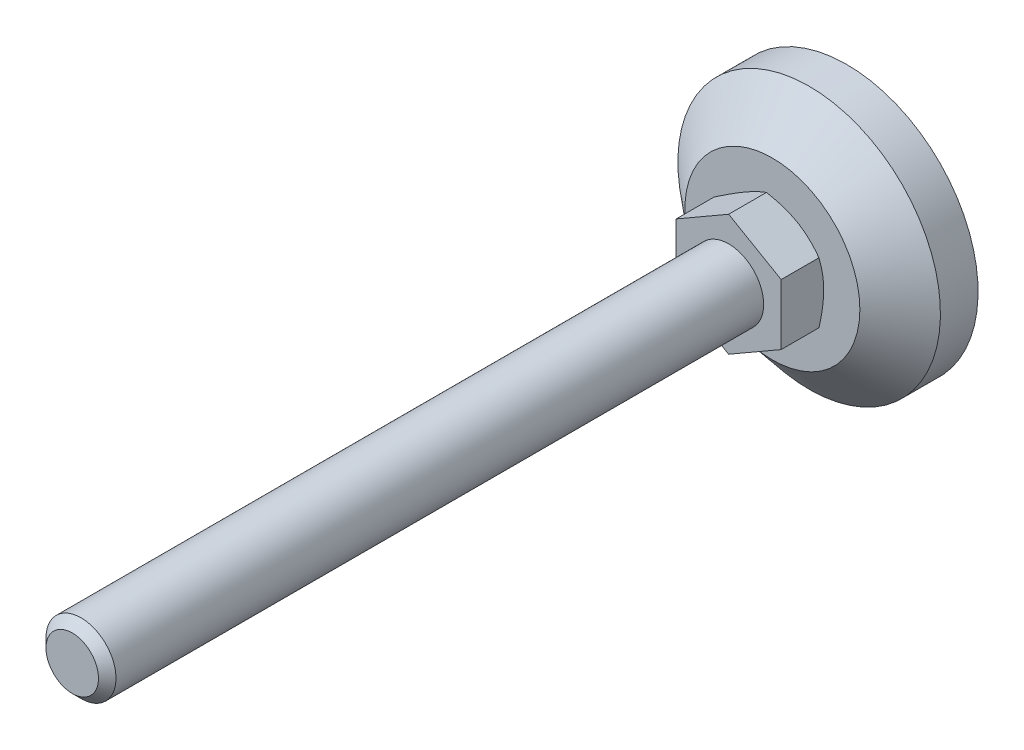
ISO-10303-21;
HEADER;
FILE_DESCRIPTION(('STEP AP214'),'2;1');
FILE_NAME('part.step','',(''),(''),'','','');
FILE_SCHEMA(('AUTOMOTIVE_DESIGN { 1 0 10303 214 1 1 1 1 }'));
ENDSEC;
DATA;
#1=APPLICATION_CONTEXT('core data for automotive mechanical design processes');
#2=APPLICATION_PROTOCOL_DEFINITION('international standard','automotive_design',2000,#1);
#3=PRODUCT_CONTEXT('',#1,'mechanical');
#4=PRODUCT('Part','Part','',(#3));
#5=PRODUCT_RELATED_PRODUCT_CATEGORY('part','',(#4));
#6=PRODUCT_DEFINITION_FORMATION('','',#4);
#7=PRODUCT_DEFINITION_CONTEXT('part definition',#1,'design');
#8=PRODUCT_DEFINITION('design','',#6,#7);
#9=PRODUCT_DEFINITION_SHAPE('','',#8);
#10=(LENGTH_UNIT() NAMED_UNIT(*) SI_UNIT(.MILLI.,.METRE.));
#11=(NAMED_UNIT(*) PLANE_ANGLE_UNIT() SI_UNIT($,.RADIAN.));
#12=(NAMED_UNIT(*) SI_UNIT($,.STERADIAN.) SOLID_ANGLE_UNIT());
#13=UNCERTAINTY_MEASURE_WITH_UNIT(LENGTH_MEASURE(1.E-05),#10,'distance_accuracy_value','');
#14=(GEOMETRIC_REPRESENTATION_CONTEXT(3) GLOBAL_UNCERTAINTY_ASSIGNED_CONTEXT((#13)) GLOBAL_UNIT_ASSIGNED_CONTEXT((#10,
#11,#12)) REPRESENTATION_CONTEXT('',''));
#15=CARTESIAN_POINT('',(0.,0.,0.));
#16=DIRECTION('',(0.,0.,1.));
#17=DIRECTION('',(1.,0.,0.));
#18=AXIS2_PLACEMENT_3D('',#15,#16,#17);
#19=CARTESIAN_POINT('',(0.,0.,27.));
#20=DIRECTION('',(0.,0.,1.));
#21=DIRECTION('',(0.5,-0.866025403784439,0.));
#22=AXIS2_PLACEMENT_3D('',#19,#20,#21);
#23=PLANE('',#22);
#24=DIRECTION('',(0.,1.,0.));
#25=VECTOR('',#24,1.);
#26=CARTESIAN_POINT('',(12.,-6.92820323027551,27.));
#27=LINE('',#26,#25);
#28=CARTESIAN_POINT('',(12.,-6.92820323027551,27.));
#29=VERTEX_POINT('',#28);
#30=CARTESIAN_POINT('',(12.,6.92820323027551,27.));
#31=VERTEX_POINT('',#30);
#32=EDGE_CURVE('E197',#29,#31,#27,.T.);
#33=ORIENTED_EDGE('',*,*,#32,.T.);
#34=DIRECTION('',(-0.866025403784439,0.5,0.));
#35=VECTOR('',#34,1.);
#36=CARTESIAN_POINT('',(12.,6.92820323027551,27.));
#37=LINE('',#36,#35);
#38=CARTESIAN_POINT('',(0.,13.856406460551,27.));
#39=VERTEX_POINT('',#38);
#40=EDGE_CURVE('E320',#31,#39,#37,.T.);
#41=ORIENTED_EDGE('',*,*,#40,.T.);
#42=DIRECTION('',(-0.866025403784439,-0.5,0.));
#43=VECTOR('',#42,1.);
#44=CARTESIAN_POINT('',(0.,13.856406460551,27.));
#45=LINE('',#44,#43);
#46=CARTESIAN_POINT('',(-12.,6.92820323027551,27.));
#47=VERTEX_POINT('',#46);
#48=EDGE_CURVE('E319',#39,#47,#45,.T.);
#49=ORIENTED_EDGE('',*,*,#48,.T.);
#50=DIRECTION('',(0.,-1.,0.));
#51=VECTOR('',#50,1.);
#52=CARTESIAN_POINT('',(-12.,6.92820323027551,27.));
#53=LINE('',#52,#51);
#54=CARTESIAN_POINT('',(-12.,-6.92820323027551,27.));
#55=VERTEX_POINT('',#54);
#56=EDGE_CURVE('E324',#47,#55,#53,.T.);
#57=ORIENTED_EDGE('',*,*,#56,.T.);
#58=DIRECTION('',(0.866025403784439,-0.5,0.));
#59=VECTOR('',#58,1.);
#60=CARTESIAN_POINT('',(-12.,-6.92820323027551,27.));
#61=LINE('',#60,#59);
#62=CARTESIAN_POINT('',(0.,-13.856406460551,27.));
#63=VERTEX_POINT('',#62);
#64=EDGE_CURVE('E326',#55,#63,#61,.T.);
#65=ORIENTED_EDGE('',*,*,#64,.T.);
#66=DIRECTION('',(0.866025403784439,0.5,0.));
#67=VECTOR('',#66,1.);
#68=CARTESIAN_POINT('',(0.,-13.856406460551,27.));
#69=LINE('',#68,#67);
#70=EDGE_CURVE('E37',#63,#29,#69,.T.);
#71=ORIENTED_EDGE('',*,*,#70,.T.);
#72=EDGE_LOOP('',(#33,#41,#49,#57,#65,#71));
#73=FACE_BOUND('',#72,.T.);
#74=CARTESIAN_POINT('',(0.,0.,27.));
#75=DIRECTION('',(0.,0.,1.));
#76=DIRECTION('',(0.5,-0.866025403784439,0.));
#77=AXIS2_PLACEMENT_3D('',#74,#75,#76);
#78=CIRCLE('',#77,8.);
#79=CARTESIAN_POINT('',(4.,-6.92820323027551,27.));
#80=VERTEX_POINT('',#79);
#81=EDGE_CURVE('E201',#80,#80,#78,.T.);
#82=ORIENTED_EDGE('',*,*,#81,.F.);
#83=EDGE_LOOP('',(#82));
#84=FACE_BOUND('',#83,.T.);
#85=ADVANCED_FACE('F14',(#73,#84),#23,.T.);
#86=CARTESIAN_POINT('',(-9.99463491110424,17.3112154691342,17.));
#87=DIRECTION('',(0.,0.,1.));
#88=DIRECTION('',(0.5,-0.866025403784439,0.));
#89=AXIS2_PLACEMENT_3D('',#86,#87,#88);
#90=PLANE('',#89);
#91=CARTESIAN_POINT('',(0.,0.,17.));
#92=DIRECTION('',(0.,0.,-1.));
#93=DIRECTION('',(-0.5,0.866025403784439,0.));
#94=AXIS2_PLACEMENT_3D('',#91,#92,#93);
#95=CIRCLE('',#94,19.9892698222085);
#96=CARTESIAN_POINT('',(-9.99463491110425,17.3112154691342,17.));
#97=VERTEX_POINT('',#96);
#98=EDGE_CURVE('E102',#97,#97,#95,.T.);
#99=ORIENTED_EDGE('',*,*,#98,.F.);
#100=EDGE_LOOP('',(#99));
#101=FACE_BOUND('',#100,.T.);
#102=CARTESIAN_POINT('',(0.,0.,17.));
#103=DIRECTION('',(0.,0.,-1.));
#104=DIRECTION('',(-0.5,0.866025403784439,0.));
#105=AXIS2_PLACEMENT_3D('',#102,#103,#104);
#106=CIRCLE('',#105,11.5);
#107=CARTESIAN_POINT('',(-5.75,9.95929214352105,17.));
#108=VERTEX_POINT('',#107);
#109=EDGE_CURVE('E84',#108,#108,#106,.T.);
#110=ORIENTED_EDGE('',*,*,#109,.T.);
#111=EDGE_LOOP('',(#110));
#112=FACE_BOUND('',#111,.T.);
#113=ADVANCED_FACE('F174',(#101,#112),#90,.T.);
#114=CARTESIAN_POINT('',(0.,0.,0.));
#115=DIRECTION('',(0.,0.,-1.));
#116=DIRECTION('',(-0.5,0.866025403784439,0.));
#117=AXIS2_PLACEMENT_3D('',#114,#115,#116);
#118=PLANE('',#117);
#119=CARTESIAN_POINT('',(0.,0.,0.));
#120=DIRECTION('',(0.,0.,-1.));
#121=DIRECTION('',(-0.5,0.866025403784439,0.));
#122=AXIS2_PLACEMENT_3D('',#119,#120,#121);
#123=CIRCLE('',#122,30.);
#124=CARTESIAN_POINT('',(-15.,25.9807621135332,0.));
#125=VERTEX_POINT('',#124);
#126=EDGE_CURVE('E73',#125,#125,#123,.T.);
#127=ORIENTED_EDGE('',*,*,#126,.T.);
#128=EDGE_LOOP('',(#127));
#129=FACE_BOUND('',#128,.T.);
#130=ADVANCED_FACE('F177',(#129),#118,.T.);
#131=CARTESIAN_POINT('',(0.,0.,-75.4972525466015));
#132=DIRECTION('',(0.,0.,-1.));
#133=DIRECTION('',(-0.5,0.866025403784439,0.));
#134=AXIS2_PLACEMENT_3D('',#131,#132,#133);
#135=CYLINDRICAL_SURFACE('',#134,30.);
#136=CARTESIAN_POINT('',(0.,0.,8.6));
#137=DIRECTION('',(0.,0.,-1.));
#138=DIRECTION('',(-0.5,0.866025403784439,0.));
#139=AXIS2_PLACEMENT_3D('',#136,#137,#138);
#140=CIRCLE('',#139,30.);
#141=CARTESIAN_POINT('',(-15.,25.9807621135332,8.6));
#142=VERTEX_POINT('',#141);
#143=EDGE_CURVE('E105',#142,#142,#140,.T.);
#144=ORIENTED_EDGE('',*,*,#143,.T.);
#145=EDGE_LOOP('',(#144));
#146=FACE_BOUND('',#145,.T.);
#147=ORIENTED_EDGE('',*,*,#126,.F.);
#148=EDGE_LOOP('',(#147));
#149=FACE_BOUND('',#148,.T.);
#150=ADVANCED_FACE('F181',(#146,#149),#135,.T.);
#151=CARTESIAN_POINT('',(0.,0.,8.6));
#152=DIRECTION('',(0.,0.,-1.));
#153=DIRECTION('',(-0.5,0.866025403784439,0.));
#154=AXIS2_PLACEMENT_3D('',#151,#152,#153);
#155=CONICAL_SURFACE('',#154,30.,0.872664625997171);
#156=ORIENTED_EDGE('',*,*,#98,.T.);
#157=EDGE_LOOP('',(#156));
#158=FACE_BOUND('',#157,.T.);
#159=ORIENTED_EDGE('',*,*,#143,.F.);
#160=EDGE_LOOP('',(#159));
#161=FACE_BOUND('',#160,.T.);
#162=ADVANCED_FACE('F121',(#158,#161),#155,.T.);
#163=CARTESIAN_POINT('',(0.,0.,20.8975219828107));
#164=DIRECTION('',(0.,0.,1.));
#165=DIRECTION('',(0.5,-0.866025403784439,0.));
#166=AXIS2_PLACEMENT_3D('',#163,#164,#165);
#167=CONICAL_SURFACE('',#166,18.2507060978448,1.0471975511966);
#168=ORIENTED_EDGE('',*,*,#109,.F.);
#169=EDGE_LOOP('',(#168));
#170=FACE_BOUND('',#169,.T.);
#171=CARTESIAN_POINT('',(-10.1845483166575,-19.7364581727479,23.1830146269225));
#172=CARTESIAN_POINT('',(-9.95731802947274,-19.6052667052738,23.0555465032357));
#173=CARTESIAN_POINT('',(-9.72982292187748,-19.4739223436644,22.9287081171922));
#174=CARTESIAN_POINT('',(-9.27424782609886,-19.2108959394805,22.6764332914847));
#175=CARTESIAN_POINT('',(-9.04616783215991,-19.0792138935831,22.5509968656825));
#176=CARTESIAN_POINT('',(-8.360907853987,-18.6835788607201,22.1769716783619));
#177=CARTESIAN_POINT('',(-7.90277404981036,-18.4190751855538,21.930704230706));
#178=CARTESIAN_POINT('',(-6.98100239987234,-17.8868900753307,21.4445247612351));
#179=CARTESIAN_POINT('',(-6.51734820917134,-17.6191992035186,21.2046539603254));
#180=CARTESIAN_POINT('',(-5.58637620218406,-17.0817022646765,20.734620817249));
#181=CARTESIAN_POINT('',(-5.11905855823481,-16.8118962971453,20.5044580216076));
#182=CARTESIAN_POINT('',(-4.16467967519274,-16.2608853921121,20.0490896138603));
#183=CARTESIAN_POINT('',(-3.67747196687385,-15.9795958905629,19.82429119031));
#184=CARTESIAN_POINT('',(-2.69737824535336,-15.413738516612,19.3915182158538));
#185=CARTESIAN_POINT('',(-2.20449160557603,-15.1291702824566,19.1835455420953));
#186=CARTESIAN_POINT('',(-1.21317256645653,-14.5568319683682,18.7898295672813));
#187=CARTESIAN_POINT('',(-0.714753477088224,-14.2690695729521,18.6040419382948));
#188=CARTESIAN_POINT('',(0.289281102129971,-13.6893899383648,18.2605950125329));
#189=CARTESIAN_POINT('',(0.794894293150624,-13.3974740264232,18.1029269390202));
#190=CARTESIAN_POINT('',(1.55740346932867,-12.9572391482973,17.8936125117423));
#191=CARTESIAN_POINT('',(1.81154649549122,-12.8105096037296,17.82851512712));
#192=CARTESIAN_POINT('',(2.3215816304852,-12.5160406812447,17.7081511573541));
#193=CARTESIAN_POINT('',(2.57747370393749,-12.3683013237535,17.652884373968));
#194=CARTESIAN_POINT('',(3.09083535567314,-12.0719118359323,17.5531523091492));
#195=CARTESIAN_POINT('',(3.34830490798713,-11.9232617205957,17.5086868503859));
#196=CARTESIAN_POINT('',(3.86455433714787,-11.6252049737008,17.4314414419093));
#197=CARTESIAN_POINT('',(4.12333416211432,-11.4757983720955,17.3986610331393));
#198=CARTESIAN_POINT('',(4.63843364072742,-11.1784055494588,17.345852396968));
#199=CARTESIAN_POINT('',(4.89474072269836,-11.0304265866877,17.3256616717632));
#200=CARTESIAN_POINT('',(5.40786438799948,-10.7341745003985,17.2978182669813));
#201=CARTESIAN_POINT('',(5.66468096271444,-10.5859013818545,17.2901653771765));
#202=CARTESIAN_POINT('',(6.17836497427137,-10.2893257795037,17.287579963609));
#203=CARTESIAN_POINT('',(6.43523241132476,-10.1410232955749,17.2926474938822));
#204=CARTESIAN_POINT('',(6.94855188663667,-9.84465815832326,17.3153783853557));
#205=CARTESIAN_POINT('',(7.20500390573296,-9.69659551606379,17.3330423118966));
#206=CARTESIAN_POINT('',(7.81927447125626,-9.34194623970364,17.3900614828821));
#207=CARTESIAN_POINT('',(8.17669346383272,-9.13559028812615,17.4352607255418));
#208=CARTESIAN_POINT('',(8.88892563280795,-8.72438285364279,17.5476838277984));
#209=CARTESIAN_POINT('',(9.24373845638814,-8.51953157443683,17.6149106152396));
#210=CARTESIAN_POINT('',(9.95040329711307,-8.11153843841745,17.7689975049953));
#211=CARTESIAN_POINT('',(10.3022528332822,-7.90839801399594,17.8558726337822));
#212=CARTESIAN_POINT('',(11.0024455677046,-7.50414155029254,18.0466010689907));
#213=CARTESIAN_POINT('',(11.3507888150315,-7.30302548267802,18.1504541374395));
#214=CARTESIAN_POINT('',(12.0517118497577,-6.89834737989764,18.3750877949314));
#215=CARTESIAN_POINT('',(12.4042127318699,-6.69483090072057,18.4961943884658));
#216=CARTESIAN_POINT('',(13.1057427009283,-6.28980238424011,18.7510771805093));
#217=CARTESIAN_POINT('',(13.4547717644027,-6.08829036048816,18.8848534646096));
#218=CARTESIAN_POINT('',(14.1495287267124,-5.68717224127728,19.1629377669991));
#219=CARTESIAN_POINT('',(14.4952576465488,-5.48756555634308,19.3072424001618));
#220=CARTESIAN_POINT('',(15.1838410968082,-5.09001171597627,19.6046702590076));
#221=CARTESIAN_POINT('',(15.5266956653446,-4.89206453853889,19.7577933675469));
#222=CARTESIAN_POINT('',(16.3531119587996,-4.41493286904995,20.1371587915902));
#223=CARTESIAN_POINT('',(16.8353860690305,-4.13649178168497,20.3671360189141));
#224=CARTESIAN_POINT('',(17.7956874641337,-3.58206151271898,20.838658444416));
#225=CARTESIAN_POINT('',(18.2737144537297,-3.3060725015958,21.0802044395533));
#226=CARTESIAN_POINT('',(19.2263411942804,-2.75607319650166,21.572480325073));
#227=CARTESIAN_POINT('',(19.7009400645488,-2.48206341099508,21.8232124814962));
#228=CARTESIAN_POINT('',(20.647182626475,-1.93575001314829,22.3319518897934));
#229=CARTESIAN_POINT('',(21.1188263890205,-1.66344635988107,22.5899589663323));
#230=CARTESIAN_POINT('',(22.060219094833,-1.11993302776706,23.1121588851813));
#231=CARTESIAN_POINT('',(22.5299651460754,-0.848725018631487,23.3763586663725));
#232=CARTESIAN_POINT('',(23.4674052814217,-0.307493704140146,23.9095679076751));
#233=CARTESIAN_POINT('',(23.9350993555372,-0.037470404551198,24.1785773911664));
#234=CARTESIAN_POINT('',(24.8686924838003,0.50153983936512,24.7205226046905));
#235=CARTESIAN_POINT('',(25.3345917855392,0.770526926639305,24.9934577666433));
#236=CARTESIAN_POINT('',(26.2649273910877,1.30765643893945,25.5426344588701));
#237=CARTESIAN_POINT('',(26.7293636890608,1.57579886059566,25.8188760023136));
#238=CARTESIAN_POINT('',(28.0397530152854,2.33235249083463,26.6032315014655));
#239=CARTESIAN_POINT('',(28.8842584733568,2.81992794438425,27.1145698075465));
#240=CARTESIAN_POINT('',(30.5701660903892,3.79328716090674,28.1440983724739));
#241=CARTESIAN_POINT('',(31.4115681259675,4.27907085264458,28.6622889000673));
#242=CARTESIAN_POINT('',(33.0897202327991,5.24795242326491,29.7025139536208));
#243=CARTESIAN_POINT('',(33.9264767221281,5.73105400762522,30.2245346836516));
#244=CARTESIAN_POINT('',(35.1801565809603,6.45486641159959,31.0105887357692));
#245=CARTESIAN_POINT('',(35.5977953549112,6.69599027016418,31.2731029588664));
#246=CARTESIAN_POINT('',(36.4326440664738,7.17799039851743,31.7990373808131));
#247=CARTESIAN_POINT('',(36.8498540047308,7.41886666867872,32.0624575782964));
#248=CARTESIAN_POINT('',(37.2668741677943,7.65963337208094,32.3262778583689));
#249=B_SPLINE_CURVE_WITH_KNOTS('',3,(#171,#172,#173,#174,#175,#176,#177,#178,#179,#180,#181,
#182,#183,#184,#185,#186,#187,#188,#189,#190,#191,#192,#193,#194,#195,#196,#197,#198,#199,#200,
#201,#202,#203,#204,#205,#206,#207,#208,#209,#210,#211,#212,#213,#214,#215,#216,#217,#218,#219,
#220,#221,#222,#223,#224,#225,#226,#227,#228,#229,#230,#231,#232,#233,#234,#235,#236,#237,#238,
#239,#240,#241,#242,#243,#244,#245,#246,#247,#248),.UNSPECIFIED.,.F.,.F.,(4,2,2,2,2,2,2,2,2,2,2,
2,2,2,2,2,2,2,2,2,2,2,2,2,2,2,2,2,2,2,2,2,2,2,2,2,2,2,4),(0.,0.875119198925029,1.75024704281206,
3.50075771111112,5.26066680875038,7.02049360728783,8.8377767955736,10.6552624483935,
12.469053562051,14.2822775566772,15.1839173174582,16.085538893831,16.9871456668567,
17.8887170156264,18.7783966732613,19.6680614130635,20.5577299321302,21.4474383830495,
22.6922901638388,23.9373074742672,25.1832801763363,26.4292354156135,27.7029922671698,
28.9767577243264,30.2501154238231,31.5234562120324,33.3307782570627,35.1382249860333,
36.9461206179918,38.7539727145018,40.5639577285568,42.3739515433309,44.1836860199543,
45.9934277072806,49.2966384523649,52.5999791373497,55.8945808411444,57.5417866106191,
59.1889898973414),.UNSPECIFIED.);
#250=CARTESIAN_POINT('',(0.,-13.856406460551,18.3604719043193));
#251=VERTEX_POINT('',#250);
#252=CARTESIAN_POINT('',(12.,-6.92820323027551,18.3604719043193));
#253=VERTEX_POINT('',#252);
#254=EDGE_CURVE('E65',#251,#253,#249,.T.);
#255=ORIENTED_EDGE('',*,*,#254,.F.);
#256=CARTESIAN_POINT('',(-12.0002,-6.92808776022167,18.3605385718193));
#257=CARTESIAN_POINT('',(-11.7364142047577,-7.08038456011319,18.2726247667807));
#258=CARTESIAN_POINT('',(-11.4716448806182,-7.2332492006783,18.1887011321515));
#259=CARTESIAN_POINT('',(-10.9399829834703,-7.54020434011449,18.0299413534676));
#260=CARTESIAN_POINT('',(-10.6730897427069,-7.69429522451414,17.9551081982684));
#261=CARTESIAN_POINT('',(-9.86810959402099,-8.15905073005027,17.7456926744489));
#262=CARTESIAN_POINT('',(-9.3268449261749,-8.47155003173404,17.6265783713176));
#263=CARTESIAN_POINT('',(-8.51686717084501,-8.93919090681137,17.4869061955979));
#264=CARTESIAN_POINT('',(-8.25057389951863,-9.09293539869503,17.4471189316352));
#265=CARTESIAN_POINT('',(-7.71675440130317,-9.40113622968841,17.3803985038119));
#266=CARTESIAN_POINT('',(-7.44922815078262,-9.55559258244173,17.3534655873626));
#267=CARTESIAN_POINT('',(-6.91372963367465,-9.86476279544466,17.3131437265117));
#268=CARTESIAN_POINT('',(-6.64575827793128,-10.0194761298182,17.2997386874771));
#269=CARTESIAN_POINT('',(-6.10956726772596,-10.3290461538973,17.286758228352));
#270=CARTESIAN_POINT('',(-5.84134762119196,-10.4839028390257,17.2871823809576));
#271=CARTESIAN_POINT('',(-5.33991062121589,-10.7734076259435,17.3008951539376));
#272=CARTESIAN_POINT('',(-5.10665750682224,-10.908076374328,17.3125111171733));
#273=CARTESIAN_POINT('',(-4.64068775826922,-11.1771041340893,17.3459831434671));
#274=CARTESIAN_POINT('',(-4.40797116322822,-11.3114631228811,17.367839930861));
#275=CARTESIAN_POINT('',(-3.94320092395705,-11.5797983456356,17.4214125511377));
#276=CARTESIAN_POINT('',(-3.71114798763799,-11.7137741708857,17.4531365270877));
#277=CARTESIAN_POINT('',(-3.24813003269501,-11.9810977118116,17.5258869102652));
#278=CARTESIAN_POINT('',(-3.01716508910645,-12.1144453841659,17.566913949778));
#279=CARTESIAN_POINT('',(-2.31605804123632,-12.5192297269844,17.7049867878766));
#280=CARTESIAN_POINT('',(-1.84794625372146,-12.789494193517,17.8158000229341));
#281=CARTESIAN_POINT('',(-0.918702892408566,-13.3259930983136,18.0673009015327));
#282=CARTESIAN_POINT('',(-0.457559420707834,-13.5922344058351,18.2079294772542));
#283=CARTESIAN_POINT('',(0.000200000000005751,-13.8565219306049,18.3605385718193));
#284=B_SPLINE_CURVE_WITH_KNOTS('',3,(#256,#257,#258,#259,#260,#261,#262,#263,#264,#265,#266,
#267,#268,#269,#270,#271,#272,#273,#274,#275,#276,#277,#278,#279,#280,#281,#282,#283),
.UNSPECIFIED.,.F.,.F.,(4,2,2,2,2,2,2,2,2,2,2,2,2,4),(0.,0.951004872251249,1.90232158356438,
3.80900466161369,4.73894551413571,5.6689042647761,6.59775529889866,7.52657763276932,
8.3351464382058,9.14377244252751,9.95306755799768,10.7624176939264,12.4167102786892,
14.0677556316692),.UNSPECIFIED.);
#285=CARTESIAN_POINT('',(-12.,-6.92820323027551,18.3604719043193));
#286=VERTEX_POINT('',#285);
#287=EDGE_CURVE('E68',#286,#251,#284,.T.);
#288=ORIENTED_EDGE('',*,*,#287,.F.);
#289=CARTESIAN_POINT('',(-12.,6.92843417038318,18.3605385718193));
#290=CARTESIAN_POINT('',(-12.,6.62384057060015,18.2726247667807));
#291=CARTESIAN_POINT('',(-12.,6.31811128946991,18.1887011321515));
#292=CARTESIAN_POINT('',(-12.,5.70420101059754,18.0299413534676));
#293=CARTESIAN_POINT('',(-12.,5.39601924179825,17.9551081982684));
#294=CARTESIAN_POINT('',(-12.,4.46650823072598,17.7456926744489));
#295=CARTESIAN_POINT('',(-12.,3.84150962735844,17.6265783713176));
#296=CARTESIAN_POINT('',(-12.,2.90622787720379,17.4869061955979));
#297=CARTESIAN_POINT('',(-12.,2.59873889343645,17.4471189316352));
#298=CARTESIAN_POINT('',(-12.,1.98233723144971,17.3803985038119));
#299=CARTESIAN_POINT('',(-12.,1.67342452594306,17.3534655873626));
#300=CARTESIAN_POINT('',(-12.,1.05508409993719,17.3131437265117));
#301=CARTESIAN_POINT('',(-12.,0.745657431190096,17.2997386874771));
#302=CARTESIAN_POINT('',(-12.,0.126517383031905,17.286758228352));
#303=CARTESIAN_POINT('',(-12.,-0.183195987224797,17.2871823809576));
#304=CARTESIAN_POINT('',(-12.,-0.76220556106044,17.3008951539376));
#305=CARTESIAN_POINT('',(-12.,-1.03154305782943,17.3125111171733));
#306=CARTESIAN_POINT('',(-12.,-1.56959857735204,17.3459831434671));
#307=CARTESIAN_POINT('',(-12.,-1.83831655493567,17.367839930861));
#308=CARTESIAN_POINT('',(-12.,-2.37498700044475,17.4214125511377));
#309=CARTESIAN_POINT('',(-12.,-2.64293865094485,17.4531365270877));
#310=CARTESIAN_POINT('',(-12.,-3.17758573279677,17.5258869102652));
#311=CARTESIAN_POINT('',(-12.,-3.44428107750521,17.566913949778));
#312=CARTESIAN_POINT('',(-12.,-4.25384976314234,17.7049867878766));
#313=CARTESIAN_POINT('',(-12.,-4.79437869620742,17.8158000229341));
#314=CARTESIAN_POINT('',(-12.,-5.86737650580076,18.0673009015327));
#315=CARTESIAN_POINT('',(-12.,-6.39985912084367,18.2079294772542));
#316=CARTESIAN_POINT('',(-12.,-6.92843417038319,18.3605385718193));
#317=B_SPLINE_CURVE_WITH_KNOTS('',3,(#289,#290,#291,#292,#293,#294,#295,#296,#297,#298,#299,
#300,#301,#302,#303,#304,#305,#306,#307,#308,#309,#310,#311,#312,#313,#314,#315,#316),
.UNSPECIFIED.,.F.,.F.,(4,2,2,2,2,2,2,2,2,2,2,2,2,4),(0.,0.951004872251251,1.90232158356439,
3.80900466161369,4.73894551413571,5.6689042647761,6.59775529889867,7.52657763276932,
8.3351464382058,9.14377244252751,9.95306755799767,10.7624176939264,12.4167102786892,
14.0677556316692),.UNSPECIFIED.);
#318=CARTESIAN_POINT('',(-12.,6.92820323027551,18.3604719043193));
#319=VERTEX_POINT('',#318);
#320=EDGE_CURVE('E83',#319,#286,#317,.T.);
#321=ORIENTED_EDGE('',*,*,#320,.F.);
#322=CARTESIAN_POINT('',(-22.184548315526,1.04815151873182,23.1830146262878));
#323=CARTESIAN_POINT('',(-21.9573180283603,1.179342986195,23.0555465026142));
#324=CARTESIAN_POINT('',(-21.729822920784,1.31068734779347,22.9287081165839));
#325=CARTESIAN_POINT('',(-21.2742478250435,1.57371375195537,22.676433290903));
#326=CARTESIAN_POINT('',(-21.0461678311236,1.7053957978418,22.550996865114));
#327=CARTESIAN_POINT('',(-20.3609078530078,2.1010308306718,22.1769716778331));
#328=CARTESIAN_POINT('',(-19.9027740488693,2.36553450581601,21.9307042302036));
#329=CARTESIAN_POINT('',(-18.9810023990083,2.89771961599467,21.4445247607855));
#330=CARTESIAN_POINT('',(-18.517348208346,3.16541048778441,21.2046539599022));
#331=CARTESIAN_POINT('',(-17.5863762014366,3.7029074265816,20.7346208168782));
#332=CARTESIAN_POINT('',(-17.1190585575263,3.97271339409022,20.5044580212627));
#333=CARTESIAN_POINT('',(-16.1646796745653,4.52372429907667,20.0490896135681));
#334=CARTESIAN_POINT('',(-15.6774719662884,4.80501380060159,19.8242911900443));
#335=CARTESIAN_POINT('',(-14.6973782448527,5.37087117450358,19.3915182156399));
#336=CARTESIAN_POINT('',(-14.2044916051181,5.65543940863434,19.1835455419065));
#337=CARTESIAN_POINT('',(-13.2131725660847,6.22777772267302,18.7898295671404));
#338=CARTESIAN_POINT('',(-12.7147534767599,6.51554011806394,18.6040419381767));
#339=CARTESIAN_POINT('',(-11.7107188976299,7.09521975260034,18.2605950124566));
#340=CARTESIAN_POINT('',(-11.2051057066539,7.38713566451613,18.1029269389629));
#341=CARTESIAN_POINT('',(-10.4425965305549,7.82737054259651,17.8936125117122));
#342=CARTESIAN_POINT('',(-10.1884535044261,7.97410008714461,17.8285151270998));
#343=CARTESIAN_POINT('',(-9.67841836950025,8.26856900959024,17.7081511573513));
#344=CARTESIAN_POINT('',(-9.42252629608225,8.41630836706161,17.6528843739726));
#345=CARTESIAN_POINT('',(-8.90916464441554,8.71269785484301,17.5531523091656));
#346=CARTESIAN_POINT('',(-8.6516950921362,8.86134797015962,17.5086868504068));
#347=CARTESIAN_POINT('',(-8.13544566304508,9.15940471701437,17.4314414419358));
#348=CARTESIAN_POINT('',(-7.87666583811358,9.30881131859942,17.3986610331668));
#349=CARTESIAN_POINT('',(-7.36156635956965,9.60620414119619,17.3458523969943));
#350=CARTESIAN_POINT('',(-7.10525927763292,9.75418310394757,17.3256616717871));
#351=CARTESIAN_POINT('',(-6.59213561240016,10.0504351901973,17.2978182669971));
#352=CARTESIAN_POINT('',(-6.33531903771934,10.1987083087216,17.2901653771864));
#353=CARTESIAN_POINT('',(-5.82163502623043,10.4952839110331,17.2875799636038));
#354=CARTESIAN_POINT('',(-5.56476758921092,10.6435863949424,17.2926474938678));
#355=CARTESIAN_POINT('',(-5.05144811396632,10.9399515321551,17.3153783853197));
#356=CARTESIAN_POINT('',(-4.79499609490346,11.0880141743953,17.3330423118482));
#357=CARTESIAN_POINT('',(-4.18072552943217,11.4426634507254,17.3900614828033));
#358=CARTESIAN_POINT('',(-3.82330653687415,11.6490194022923,17.4352607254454));
#359=CARTESIAN_POINT('',(-3.11107436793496,12.0602268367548,17.547683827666));
#360=CARTESIAN_POINT('',(-2.75626154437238,12.2650781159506,17.6149106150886));
#361=CARTESIAN_POINT('',(-2.04959670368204,12.67307125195,17.768997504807));
#362=CARTESIAN_POINT('',(-1.69774716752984,12.8762116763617,17.8558726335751));
#363=CARTESIAN_POINT('',(-0.997554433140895,13.2804681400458,18.0466010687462));
#364=CARTESIAN_POINT('',(-0.649211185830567,13.4815842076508,18.1504541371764));
#365=CARTESIAN_POINT('',(0.0517118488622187,13.8862623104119,18.3750877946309));
#366=CARTESIAN_POINT('',(0.404212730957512,14.0897787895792,18.4961943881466));
#367=CARTESIAN_POINT('',(1.10574269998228,14.4948073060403,18.7510771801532));
#368=CARTESIAN_POINT('',(1.45477176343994,14.6963193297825,18.8848534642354));
#369=CARTESIAN_POINT('',(2.1495287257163,15.0974374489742,19.1629377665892));
#370=CARTESIAN_POINT('',(2.49525764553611,15.2970441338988,19.3072423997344));
#371=CARTESIAN_POINT('',(3.18384109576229,15.6945979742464,19.6046702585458));
#372=CARTESIAN_POINT('',(3.52669566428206,15.8925451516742,19.7577933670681));
#373=CARTESIAN_POINT('',(4.3531119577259,16.3696768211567,20.1371587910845));
#374=CARTESIAN_POINT('',(4.83538606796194,16.6481179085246,20.3671360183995));
#375=CARTESIAN_POINT('',(5.7956874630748,17.2025481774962,20.838658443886));
#376=CARTESIAN_POINT('',(6.27371445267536,17.478537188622,21.0802044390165));
#377=CARTESIAN_POINT('',(7.22634119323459,18.0285364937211,21.5724803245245));
#378=CARTESIAN_POINT('',(7.7009400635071,18.30254627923,21.8232124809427));
#379=CARTESIAN_POINT('',(8.64718262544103,18.8488596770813,22.3319518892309));
#380=CARTESIAN_POINT('',(9.11882638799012,19.1211633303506,22.589958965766));
#381=CARTESIAN_POINT('',(10.0602190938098,19.6646766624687,23.1121588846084));
#382=CARTESIAN_POINT('',(10.5299651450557,19.9358846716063,23.3763586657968));
#383=CARTESIAN_POINT('',(11.4674052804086,20.4771159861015,23.9095679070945));
#384=CARTESIAN_POINT('',(11.9350993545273,20.7471392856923,24.1785773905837));
#385=CARTESIAN_POINT('',(12.8686924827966,21.2861495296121,24.7205226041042));
#386=CARTESIAN_POINT('',(13.3345917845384,21.555136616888,24.9934577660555));
#387=CARTESIAN_POINT('',(14.2649273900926,22.0922661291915,25.5426344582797));
#388=CARTESIAN_POINT('',(14.7293636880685,22.3604085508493,25.8188760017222));
#389=CARTESIAN_POINT('',(16.0397530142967,23.1169621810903,26.6032315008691));
#390=CARTESIAN_POINT('',(16.8842584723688,23.6045376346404,27.1145698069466));
#391=CARTESIAN_POINT('',(18.5701660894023,24.5778968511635,28.1440983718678));
#392=CARTESIAN_POINT('',(19.411568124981,25.0636805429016,28.6622888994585));
#393=CARTESIAN_POINT('',(21.0897202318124,26.0325621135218,29.7025139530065));
#394=CARTESIAN_POINT('',(21.9264767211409,26.5156636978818,30.2245346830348));
#395=CARTESIAN_POINT('',(23.1801565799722,27.2394761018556,31.0105887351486));
#396=CARTESIAN_POINT('',(23.5977953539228,27.48059996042,31.2731029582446));
#397=CARTESIAN_POINT('',(24.4326440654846,27.9626000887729,31.799037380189));
#398=CARTESIAN_POINT('',(24.8498540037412,28.2034763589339,32.0624575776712));
#399=CARTESIAN_POINT('',(25.2668741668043,28.4442430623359,32.3262778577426));
#400=B_SPLINE_CURVE_WITH_KNOTS('',3,(#322,#323,#324,#325,#326,#327,#328,#329,#330,#331,#332,
#333,#334,#335,#336,#337,#338,#339,#340,#341,#342,#343,#344,#345,#346,#347,#348,#349,#350,#351,
#352,#353,#354,#355,#356,#357,#358,#359,#360,#361,#362,#363,#364,#365,#366,#367,#368,#369,#370,
#371,#372,#373,#374,#375,#376,#377,#378,#379,#380,#381,#382,#383,#384,#385,#386,#387,#388,#389,
#390,#391,#392,#393,#394,#395,#396,#397,#398,#399),.UNSPECIFIED.,.F.,.F.,(4,2,2,2,2,2,2,2,2,2,2,
2,2,2,2,2,2,2,2,2,2,2,2,2,2,2,2,2,2,2,2,2,2,2,2,2,2,2,4),(0.,0.875119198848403,1.7502470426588,
3.50075771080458,5.2606668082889,7.02049360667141,8.83777679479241,10.6552624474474,
12.4690535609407,14.2822775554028,15.183917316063,16.085538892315,16.9871456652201,
17.8887170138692,18.7783966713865,19.668061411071,20.55772993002,21.4474383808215,
22.6922901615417,23.9373074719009,25.1832801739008,26.4292354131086,27.7029922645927,
28.9767577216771,30.2501154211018,31.523456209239,33.3307782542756,35.1382249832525,
36.9461206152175,38.7539727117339,40.5639577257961,42.3739515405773,44.1836860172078,
45.9934277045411,49.2966384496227,52.5999791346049,55.8945808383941,57.541786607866,
59.1889898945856),.UNSPECIFIED.);
#401=CARTESIAN_POINT('',(0.,13.856406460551,18.3604719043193));
#402=VERTEX_POINT('',#401);
#403=EDGE_CURVE('E143',#402,#319,#400,.F.);
#404=ORIENTED_EDGE('',*,*,#403,.F.);
#405=CARTESIAN_POINT('',(12.0002,6.92808776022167,18.3605385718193));
#406=CARTESIAN_POINT('',(11.7364142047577,7.08038456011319,18.2726247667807));
#407=CARTESIAN_POINT('',(11.4716448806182,7.2332492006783,18.1887011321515));
#408=CARTESIAN_POINT('',(10.9399829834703,7.54020434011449,18.0299413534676));
#409=CARTESIAN_POINT('',(10.6730897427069,7.69429522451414,17.9551081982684));
#410=CARTESIAN_POINT('',(9.86810959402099,8.15905073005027,17.7456926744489));
#411=CARTESIAN_POINT('',(9.3268449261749,8.47155003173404,17.6265783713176));
#412=CARTESIAN_POINT('',(8.51686717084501,8.93919090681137,17.4869061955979));
#413=CARTESIAN_POINT('',(8.25057389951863,9.09293539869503,17.4471189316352));
#414=CARTESIAN_POINT('',(7.71675440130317,9.40113622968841,17.3803985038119));
#415=CARTESIAN_POINT('',(7.44922815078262,9.55559258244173,17.3534655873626));
#416=CARTESIAN_POINT('',(6.91372963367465,9.86476279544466,17.3131437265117));
#417=CARTESIAN_POINT('',(6.64575827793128,10.0194761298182,17.2997386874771));
#418=CARTESIAN_POINT('',(6.10956726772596,10.3290461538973,17.286758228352));
#419=CARTESIAN_POINT('',(5.84134762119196,10.4839028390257,17.2871823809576));
#420=CARTESIAN_POINT('',(5.33991062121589,10.7734076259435,17.3008951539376));
#421=CARTESIAN_POINT('',(5.10665750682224,10.908076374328,17.3125111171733));
#422=CARTESIAN_POINT('',(4.64068775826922,11.1771041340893,17.3459831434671));
#423=CARTESIAN_POINT('',(4.40797116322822,11.3114631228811,17.367839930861));
#424=CARTESIAN_POINT('',(3.94320092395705,11.5797983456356,17.4214125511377));
#425=CARTESIAN_POINT('',(3.71114798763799,11.7137741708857,17.4531365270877));
#426=CARTESIAN_POINT('',(3.24813003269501,11.9810977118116,17.5258869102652));
#427=CARTESIAN_POINT('',(3.01716508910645,12.1144453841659,17.566913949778));
#428=CARTESIAN_POINT('',(2.31605804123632,12.5192297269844,17.7049867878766));
#429=CARTESIAN_POINT('',(1.84794625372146,12.789494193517,17.8158000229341));
#430=CARTESIAN_POINT('',(0.918702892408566,13.3259930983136,18.0673009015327));
#431=CARTESIAN_POINT('',(0.457559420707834,13.5922344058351,18.2079294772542));
#432=CARTESIAN_POINT('',(-0.000200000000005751,13.8565219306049,18.3605385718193));
#433=B_SPLINE_CURVE_WITH_KNOTS('',3,(#405,#406,#407,#408,#409,#410,#411,#412,#413,#414,#415,
#416,#417,#418,#419,#420,#421,#422,#423,#424,#425,#426,#427,#428,#429,#430,#431,#432),
.UNSPECIFIED.,.F.,.F.,(4,2,2,2,2,2,2,2,2,2,2,2,2,4),(0.,0.951004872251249,1.90232158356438,
3.80900466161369,4.73894551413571,5.6689042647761,6.59775529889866,7.52657763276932,
8.3351464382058,9.14377244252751,9.95306755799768,10.7624176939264,12.4167102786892,
14.0677556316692),.UNSPECIFIED.);
#434=CARTESIAN_POINT('',(12.,6.92820323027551,18.3604719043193));
#435=VERTEX_POINT('',#434);
#436=EDGE_CURVE('E150',#435,#402,#433,.T.);
#437=ORIENTED_EDGE('',*,*,#436,.F.);
#438=CARTESIAN_POINT('',(12.,-6.92843417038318,18.3605385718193));
#439=CARTESIAN_POINT('',(12.,-6.62384057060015,18.2726247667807));
#440=CARTESIAN_POINT('',(12.,-6.31811128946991,18.1887011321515));
#441=CARTESIAN_POINT('',(12.,-5.70420101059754,18.0299413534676));
#442=CARTESIAN_POINT('',(12.,-5.39601924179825,17.9551081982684));
#443=CARTESIAN_POINT('',(12.,-4.46650823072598,17.7456926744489));
#444=CARTESIAN_POINT('',(12.,-3.84150962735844,17.6265783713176));
#445=CARTESIAN_POINT('',(12.,-2.90622787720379,17.4869061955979));
#446=CARTESIAN_POINT('',(12.,-2.59873889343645,17.4471189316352));
#447=CARTESIAN_POINT('',(12.,-1.98233723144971,17.3803985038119));
#448=CARTESIAN_POINT('',(12.,-1.67342452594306,17.3534655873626));
#449=CARTESIAN_POINT('',(12.,-1.05508409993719,17.3131437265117));
#450=CARTESIAN_POINT('',(12.,-0.745657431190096,17.2997386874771));
#451=CARTESIAN_POINT('',(12.,-0.126517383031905,17.286758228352));
#452=CARTESIAN_POINT('',(12.,0.183195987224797,17.2871823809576));
#453=CARTESIAN_POINT('',(12.,0.76220556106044,17.3008951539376));
#454=CARTESIAN_POINT('',(12.,1.03154305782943,17.3125111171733));
#455=CARTESIAN_POINT('',(12.,1.56959857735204,17.3459831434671));
#456=CARTESIAN_POINT('',(12.,1.83831655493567,17.367839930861));
#457=CARTESIAN_POINT('',(12.,2.37498700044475,17.4214125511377));
#458=CARTESIAN_POINT('',(12.,2.64293865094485,17.4531365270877));
#459=CARTESIAN_POINT('',(12.,3.17758573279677,17.5258869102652));
#460=CARTESIAN_POINT('',(12.,3.44428107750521,17.566913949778));
#461=CARTESIAN_POINT('',(12.,4.25384976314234,17.7049867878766));
#462=CARTESIAN_POINT('',(12.,4.79437869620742,17.8158000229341));
#463=CARTESIAN_POINT('',(12.,5.86737650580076,18.0673009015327));
#464=CARTESIAN_POINT('',(12.,6.39985912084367,18.2079294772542));
#465=CARTESIAN_POINT('',(12.,6.92843417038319,18.3605385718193));
#466=B_SPLINE_CURVE_WITH_KNOTS('',3,(#438,#439,#440,#441,#442,#443,#444,#445,#446,#447,#448,
#449,#450,#451,#452,#453,#454,#455,#456,#457,#458,#459,#460,#461,#462,#463,#464,#465),
.UNSPECIFIED.,.F.,.F.,(4,2,2,2,2,2,2,2,2,2,2,2,2,4),(0.,0.951004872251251,1.90232158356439,
3.80900466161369,4.73894551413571,5.6689042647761,6.59775529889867,7.52657763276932,
8.3351464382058,9.14377244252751,9.95306755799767,10.7624176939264,12.4167102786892,
14.0677556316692),.UNSPECIFIED.);
#467=EDGE_CURVE('E29',#253,#435,#466,.T.);
#468=ORIENTED_EDGE('',*,*,#467,.F.);
#469=EDGE_LOOP('',(#255,#288,#321,#404,#437,#468));
#470=FACE_BOUND('',#469,.T.);
#471=ADVANCED_FACE('F67',(#170,#470),#167,.T.);
#472=CARTESIAN_POINT('',(0.,-13.856406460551,27.));
#473=DIRECTION('',(-0.5,0.866025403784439,0.));
#474=DIRECTION('',(-0.866025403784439,-0.5,0.));
#475=AXIS2_PLACEMENT_3D('',#472,#473,#474);
#476=PLANE('',#475);
#477=DIRECTION('',(0.,0.,-1.));
#478=VECTOR('',#477,1.);
#479=CARTESIAN_POINT('',(0.,-13.856406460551,27.));
#480=LINE('',#479,#478);
#481=EDGE_CURVE('E80',#63,#251,#480,.T.);
#482=ORIENTED_EDGE('',*,*,#481,.T.);
#483=ORIENTED_EDGE('',*,*,#254,.T.);
#484=DIRECTION('',(0.,0.,-1.));
#485=VECTOR('',#484,1.);
#486=CARTESIAN_POINT('',(12.,-6.92820323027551,27.));
#487=LINE('',#486,#485);
#488=EDGE_CURVE('E87',#29,#253,#487,.T.);
#489=ORIENTED_EDGE('',*,*,#488,.F.);
#490=ORIENTED_EDGE('',*,*,#70,.F.);
#491=EDGE_LOOP('',(#482,#483,#489,#490));
#492=FACE_BOUND('',#491,.T.);
#493=ADVANCED_FACE('F86',(#492),#476,.F.);
#494=CARTESIAN_POINT('',(-12.,-6.92820323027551,27.));
#495=DIRECTION('',(0.5,0.866025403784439,0.));
#496=DIRECTION('',(-0.866025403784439,0.5,0.));
#497=AXIS2_PLACEMENT_3D('',#494,#495,#496);
#498=PLANE('',#497);
#499=DIRECTION('',(0.,0.,-1.));
#500=VECTOR('',#499,1.);
#501=CARTESIAN_POINT('',(-12.,-6.92820323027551,27.));
#502=LINE('',#501,#500);
#503=EDGE_CURVE('E82',#55,#286,#502,.T.);
#504=ORIENTED_EDGE('',*,*,#503,.T.);
#505=ORIENTED_EDGE('',*,*,#287,.T.);
#506=ORIENTED_EDGE('',*,*,#481,.F.);
#507=ORIENTED_EDGE('',*,*,#64,.F.);
#508=EDGE_LOOP('',(#504,#505,#506,#507));
#509=FACE_BOUND('',#508,.T.);
#510=ADVANCED_FACE('F78',(#509),#498,.F.);
#511=CARTESIAN_POINT('',(-12.,6.92820323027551,27.));
#512=DIRECTION('',(1.,0.,0.));
#513=DIRECTION('',(0.,1.,0.));
#514=AXIS2_PLACEMENT_3D('',#511,#512,#513);
#515=PLANE('',#514);
#516=DIRECTION('',(0.,0.,-1.));
#517=VECTOR('',#516,1.);
#518=CARTESIAN_POINT('',(-12.,6.92820323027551,27.));
#519=LINE('',#518,#517);
#520=EDGE_CURVE('E89',#47,#319,#519,.T.);
#521=ORIENTED_EDGE('',*,*,#520,.T.);
#522=ORIENTED_EDGE('',*,*,#320,.T.);
#523=ORIENTED_EDGE('',*,*,#503,.F.);
#524=ORIENTED_EDGE('',*,*,#56,.F.);
#525=EDGE_LOOP('',(#521,#522,#523,#524));
#526=FACE_BOUND('',#525,.T.);
#527=ADVANCED_FACE('F297',(#526),#515,.F.);
#528=CARTESIAN_POINT('',(0.,13.856406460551,27.));
#529=DIRECTION('',(0.5,-0.866025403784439,0.));
#530=DIRECTION('',(0.866025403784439,0.5,0.));
#531=AXIS2_PLACEMENT_3D('',#528,#529,#530);
#532=PLANE('',#531);
#533=DIRECTION('',(0.,0.,-1.));
#534=VECTOR('',#533,1.);
#535=CARTESIAN_POINT('',(0.,13.856406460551,27.));
#536=LINE('',#535,#534);
#537=EDGE_CURVE('E96',#39,#402,#536,.T.);
#538=ORIENTED_EDGE('',*,*,#537,.T.);
#539=ORIENTED_EDGE('',*,*,#403,.T.);
#540=ORIENTED_EDGE('',*,*,#520,.F.);
#541=ORIENTED_EDGE('',*,*,#48,.F.);
#542=EDGE_LOOP('',(#538,#539,#540,#541));
#543=FACE_BOUND('',#542,.T.);
#544=ADVANCED_FACE('F167',(#543),#532,.F.);
#545=CARTESIAN_POINT('',(12.,6.92820323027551,27.));
#546=DIRECTION('',(-0.5,-0.866025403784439,0.));
#547=DIRECTION('',(0.866025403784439,-0.5,0.));
#548=AXIS2_PLACEMENT_3D('',#545,#546,#547);
#549=PLANE('',#548);
#550=DIRECTION('',(0.,0.,-1.));
#551=VECTOR('',#550,1.);
#552=CARTESIAN_POINT('',(12.,6.92820323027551,27.));
#553=LINE('',#552,#551);
#554=EDGE_CURVE('E99',#31,#435,#553,.T.);
#555=ORIENTED_EDGE('',*,*,#554,.T.);
#556=ORIENTED_EDGE('',*,*,#436,.T.);
#557=ORIENTED_EDGE('',*,*,#537,.F.);
#558=ORIENTED_EDGE('',*,*,#40,.F.);
#559=EDGE_LOOP('',(#555,#556,#557,#558));
#560=FACE_BOUND('',#559,.T.);
#561=ADVANCED_FACE('F163',(#560),#549,.F.);
#562=CARTESIAN_POINT('',(12.,-6.92820323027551,27.));
#563=DIRECTION('',(-1.,0.,0.));
#564=DIRECTION('',(0.,-1.,0.));
#565=AXIS2_PLACEMENT_3D('',#562,#563,#564);
#566=PLANE('',#565);
#567=ORIENTED_EDGE('',*,*,#488,.T.);
#568=ORIENTED_EDGE('',*,*,#467,.T.);
#569=ORIENTED_EDGE('',*,*,#554,.F.);
#570=ORIENTED_EDGE('',*,*,#32,.F.);
#571=EDGE_LOOP('',(#567,#568,#569,#570));
#572=FACE_BOUND('',#571,.T.);
#573=ADVANCED_FACE('F166',(#572),#566,.F.);
#574=CARTESIAN_POINT('',(0.,0.,177.));
#575=DIRECTION('',(0.,0.,-1.));
#576=DIRECTION('',(-0.5,0.866025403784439,0.));
#577=AXIS2_PLACEMENT_3D('',#574,#575,#576);
#578=CYLINDRICAL_SURFACE('',#577,8.);
#579=CARTESIAN_POINT('',(0.,0.,175.));
#580=DIRECTION('',(0.,0.,1.));
#581=DIRECTION('',(0.5,-0.866025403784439,0.));
#582=AXIS2_PLACEMENT_3D('',#579,#580,#581);
#583=CIRCLE('',#582,8.);
#584=CARTESIAN_POINT('',(4.,-6.92820323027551,175.));
#585=VERTEX_POINT('',#584);
#586=EDGE_CURVE('E9',#585,#585,#583,.F.);
#587=ORIENTED_EDGE('',*,*,#586,.T.);
#588=EDGE_LOOP('',(#587));
#589=FACE_BOUND('',#588,.T.);
#590=ORIENTED_EDGE('',*,*,#81,.T.);
#591=EDGE_LOOP('',(#590));
#592=FACE_BOUND('',#591,.T.);
#593=ADVANCED_FACE('F123',(#589,#592),#578,.T.);
#594=CARTESIAN_POINT('',(0.,0.,177.));
#595=DIRECTION('',(0.,0.,1.));
#596=DIRECTION('',(0.5,-0.866025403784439,0.));
#597=AXIS2_PLACEMENT_3D('',#594,#595,#596);
#598=PLANE('',#597);
#599=CARTESIAN_POINT('',(0.,0.,177.));
#600=DIRECTION('',(0.,0.,1.));
#601=DIRECTION('',(0.5,-0.866025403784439,0.));
#602=AXIS2_PLACEMENT_3D('',#599,#600,#601);
#603=CIRCLE('',#602,6.);
#604=CARTESIAN_POINT('',(3.,-5.19615242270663,177.));
#605=VERTEX_POINT('',#604);
#606=EDGE_CURVE('E22',#605,#605,#603,.T.);
#607=ORIENTED_EDGE('',*,*,#606,.T.);
#608=EDGE_LOOP('',(#607));
#609=FACE_BOUND('',#608,.T.);
#610=ADVANCED_FACE('F208',(#609),#598,.T.);
#611=CARTESIAN_POINT('',(0.,0.,177.));
#612=DIRECTION('',(0.,0.,-1.));
#613=DIRECTION('',(-0.5,0.866025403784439,0.));
#614=AXIS2_PLACEMENT_3D('',#611,#612,#613);
#615=CONICAL_SURFACE('',#614,6.,0.785398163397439);
#616=ORIENTED_EDGE('',*,*,#586,.F.);
#617=EDGE_LOOP('',(#616));
#618=FACE_BOUND('',#617,.T.);
#619=ORIENTED_EDGE('',*,*,#606,.F.);
#620=EDGE_LOOP('',(#619));
#621=FACE_BOUND('',#620,.T.);
#622=ADVANCED_FACE('F16',(#618,#621),#615,.T.);
#623=CLOSED_SHELL('',(#85,#113,#130,#150,#162,#471,#493,#510,#527,#544,#561,#573,#593,#610,#622));
#624=MANIFOLD_SOLID_BREP('B1',#623);
#625=ADVANCED_BREP_SHAPE_REPRESENTATION('',(#18,#624),#14);
#626=SHAPE_DEFINITION_REPRESENTATION(#9,#625);
ENDSEC;
END-ISO-10303-21;
